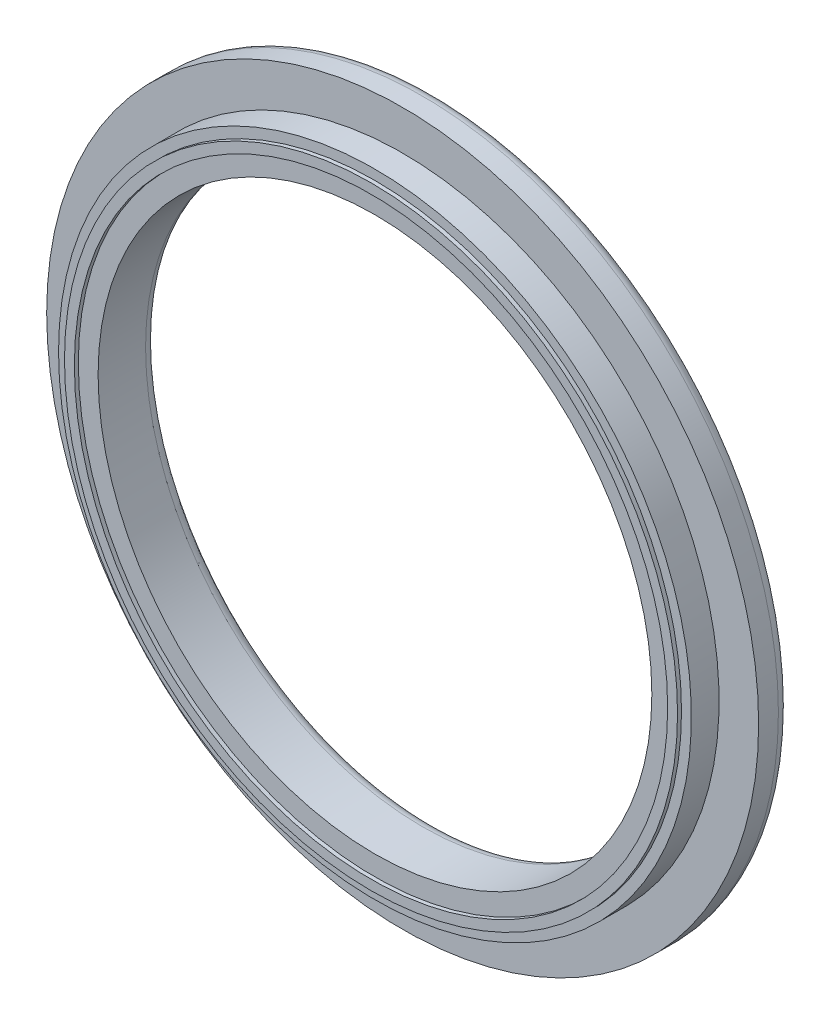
ISO-10303-21;
HEADER;
FILE_DESCRIPTION(('STEP AP214'),'2;1');
FILE_NAME('part.step','',(''),(''),'','','');
FILE_SCHEMA(('AUTOMOTIVE_DESIGN { 1 0 10303 214 1 1 1 1 }'));
ENDSEC;
DATA;
#1=APPLICATION_CONTEXT('core data for automotive mechanical design processes');
#2=APPLICATION_PROTOCOL_DEFINITION('international standard','automotive_design',2000,#1);
#3=PRODUCT_CONTEXT('',#1,'mechanical');
#4=PRODUCT('Part','Part','',(#3));
#5=PRODUCT_RELATED_PRODUCT_CATEGORY('part','',(#4));
#6=PRODUCT_DEFINITION_FORMATION('','',#4);
#7=PRODUCT_DEFINITION_CONTEXT('part definition',#1,'design');
#8=PRODUCT_DEFINITION('design','',#6,#7);
#9=PRODUCT_DEFINITION_SHAPE('','',#8);
#10=(LENGTH_UNIT() NAMED_UNIT(*) SI_UNIT(.MILLI.,.METRE.));
#11=(NAMED_UNIT(*) PLANE_ANGLE_UNIT() SI_UNIT($,.RADIAN.));
#12=(NAMED_UNIT(*) SI_UNIT($,.STERADIAN.) SOLID_ANGLE_UNIT());
#13=UNCERTAINTY_MEASURE_WITH_UNIT(LENGTH_MEASURE(1.E-05),#10,'distance_accuracy_value','');
#14=(GEOMETRIC_REPRESENTATION_CONTEXT(3) GLOBAL_UNCERTAINTY_ASSIGNED_CONTEXT((#13)) GLOBAL_UNIT_ASSIGNED_CONTEXT((#10,
#11,#12)) REPRESENTATION_CONTEXT('',''));
#15=CARTESIAN_POINT('',(0.,0.,0.));
#16=DIRECTION('',(0.,0.,1.));
#17=DIRECTION('',(1.,0.,0.));
#18=AXIS2_PLACEMENT_3D('',#15,#16,#17);
#19=CARTESIAN_POINT('',(0.,0.,1.6));
#20=DIRECTION('',(0.,0.,-1.));
#21=DIRECTION('',(-1.,0.,0.));
#22=AXIS2_PLACEMENT_3D('',#19,#20,#21);
#23=CYLINDRICAL_SURFACE('',#22,7.75);
#24=CARTESIAN_POINT('',(0.,0.,1.5));
#25=DIRECTION('',(0.,0.,-1.));
#26=DIRECTION('',(-1.,0.,0.));
#27=AXIS2_PLACEMENT_3D('',#24,#25,#26);
#28=CIRCLE('',#27,7.75);
#29=CARTESIAN_POINT('',(-7.75,0.,1.5));
#30=VERTEX_POINT('',#29);
#31=EDGE_CURVE('E123',#30,#30,#28,.T.);
#32=ORIENTED_EDGE('',*,*,#31,.F.);
#33=EDGE_LOOP('',(#32));
#34=FACE_BOUND('',#33,.T.);
#35=CARTESIAN_POINT('',(0.,0.,1.6));
#36=DIRECTION('',(0.,0.,-1.));
#37=DIRECTION('',(-1.,0.,0.));
#38=AXIS2_PLACEMENT_3D('',#35,#36,#37);
#39=CIRCLE('',#38,7.75);
#40=CARTESIAN_POINT('',(-7.75,0.,1.6));
#41=VERTEX_POINT('',#40);
#42=EDGE_CURVE('E125',#41,#41,#39,.F.);
#43=ORIENTED_EDGE('',*,*,#42,.F.);
#44=EDGE_LOOP('',(#43));
#45=FACE_BOUND('',#44,.T.);
#46=ADVANCED_FACE('F17',(#34,#45),#23,.T.);
#47=CARTESIAN_POINT('',(0.,0.,1.6));
#48=DIRECTION('',(0.,0.,1.));
#49=DIRECTION('',(1.,0.,0.));
#50=AXIS2_PLACEMENT_3D('',#47,#48,#49);
#51=PLANE('',#50);
#52=CARTESIAN_POINT('',(0.,0.,1.6));
#53=DIRECTION('',(0.,0.,-1.));
#54=DIRECTION('',(-1.,0.,0.));
#55=AXIS2_PLACEMENT_3D('',#52,#53,#54);
#56=CIRCLE('',#55,7.5);
#57=CARTESIAN_POINT('',(-7.5,0.,1.6));
#58=VERTEX_POINT('',#57);
#59=EDGE_CURVE('E120',#58,#58,#56,.T.);
#60=ORIENTED_EDGE('',*,*,#59,.T.);
#61=EDGE_LOOP('',(#60));
#62=FACE_BOUND('',#61,.T.);
#63=ORIENTED_EDGE('',*,*,#42,.T.);
#64=EDGE_LOOP('',(#63));
#65=FACE_BOUND('',#64,.T.);
#66=ADVANCED_FACE('F129',(#62,#65),#51,.T.);
#67=CARTESIAN_POINT('',(0.,0.,1.5));
#68=DIRECTION('',(0.,0.,1.));
#69=DIRECTION('',(1.,0.,0.));
#70=AXIS2_PLACEMENT_3D('',#67,#68,#69);
#71=PLANE('',#70);
#72=ORIENTED_EDGE('',*,*,#31,.T.);
#73=EDGE_LOOP('',(#72));
#74=FACE_BOUND('',#73,.T.);
#75=CARTESIAN_POINT('',(0.,0.,1.5));
#76=DIRECTION('',(0.,0.,-1.));
#77=DIRECTION('',(-1.,0.,0.));
#78=AXIS2_PLACEMENT_3D('',#75,#76,#77);
#79=CIRCLE('',#78,8.);
#80=CARTESIAN_POINT('',(-8.,0.,1.5));
#81=VERTEX_POINT('',#80);
#82=EDGE_CURVE('E117',#81,#81,#79,.T.);
#83=ORIENTED_EDGE('',*,*,#82,.F.);
#84=EDGE_LOOP('',(#83));
#85=FACE_BOUND('',#84,.T.);
#86=ADVANCED_FACE('F137',(#74,#85),#71,.T.);
#87=CARTESIAN_POINT('',(0.,0.,1.6));
#88=DIRECTION('',(0.,0.,-1.));
#89=DIRECTION('',(-1.,0.,0.));
#90=AXIS2_PLACEMENT_3D('',#87,#88,#89);
#91=CYLINDRICAL_SURFACE('',#90,7.5);
#92=CARTESIAN_POINT('',(0.,0.,1.5));
#93=DIRECTION('',(0.,0.,-1.));
#94=DIRECTION('',(-1.,0.,0.));
#95=AXIS2_PLACEMENT_3D('',#92,#93,#94);
#96=CIRCLE('',#95,7.5);
#97=CARTESIAN_POINT('',(-7.5,0.,1.5));
#98=VERTEX_POINT('',#97);
#99=EDGE_CURVE('E114',#98,#98,#96,.F.);
#100=ORIENTED_EDGE('',*,*,#99,.F.);
#101=EDGE_LOOP('',(#100));
#102=FACE_BOUND('',#101,.T.);
#103=ORIENTED_EDGE('',*,*,#59,.F.);
#104=EDGE_LOOP('',(#103));
#105=FACE_BOUND('',#104,.T.);
#106=ADVANCED_FACE('F184',(#102,#105),#91,.F.);
#107=CARTESIAN_POINT('',(0.,0.,1.5));
#108=DIRECTION('',(0.,0.,-1.));
#109=DIRECTION('',(-1.,0.,0.));
#110=AXIS2_PLACEMENT_3D('',#107,#108,#109);
#111=CYLINDRICAL_SURFACE('',#110,8.);
#112=CARTESIAN_POINT('',(0.,0.,0.8));
#113=DIRECTION('',(0.,0.,-1.));
#114=DIRECTION('',(-1.,0.,0.));
#115=AXIS2_PLACEMENT_3D('',#112,#113,#114);
#116=CIRCLE('',#115,8.);
#117=CARTESIAN_POINT('',(-8.,0.,0.8));
#118=VERTEX_POINT('',#117);
#119=EDGE_CURVE('E111',#118,#118,#116,.T.);
#120=ORIENTED_EDGE('',*,*,#119,.F.);
#121=EDGE_LOOP('',(#120));
#122=FACE_BOUND('',#121,.T.);
#123=ORIENTED_EDGE('',*,*,#82,.T.);
#124=EDGE_LOOP('',(#123));
#125=FACE_BOUND('',#124,.T.);
#126=ADVANCED_FACE('F180',(#122,#125),#111,.T.);
#127=CARTESIAN_POINT('',(0.,0.,1.5));
#128=DIRECTION('',(0.,0.,1.));
#129=DIRECTION('',(1.,0.,0.));
#130=AXIS2_PLACEMENT_3D('',#127,#128,#129);
#131=PLANE('',#130);
#132=CARTESIAN_POINT('',(0.,0.,1.5));
#133=DIRECTION('',(0.,0.,-1.));
#134=DIRECTION('',(-1.,0.,0.));
#135=AXIS2_PLACEMENT_3D('',#132,#133,#134);
#136=CIRCLE('',#135,7.);
#137=CARTESIAN_POINT('',(-7.,0.,1.5));
#138=VERTEX_POINT('',#137);
#139=EDGE_CURVE('E108',#138,#138,#136,.T.);
#140=ORIENTED_EDGE('',*,*,#139,.T.);
#141=EDGE_LOOP('',(#140));
#142=FACE_BOUND('',#141,.T.);
#143=ORIENTED_EDGE('',*,*,#99,.T.);
#144=EDGE_LOOP('',(#143));
#145=FACE_BOUND('',#144,.T.);
#146=ADVANCED_FACE('F176',(#142,#145),#131,.T.);
#147=CARTESIAN_POINT('',(0.,0.,0.8));
#148=DIRECTION('',(0.,0.,1.));
#149=DIRECTION('',(1.,0.,0.));
#150=AXIS2_PLACEMENT_3D('',#147,#148,#149);
#151=PLANE('',#150);
#152=ORIENTED_EDGE('',*,*,#119,.T.);
#153=EDGE_LOOP('',(#152));
#154=FACE_BOUND('',#153,.T.);
#155=CARTESIAN_POINT('',(0.,0.,0.8));
#156=DIRECTION('',(0.,0.,-1.));
#157=DIRECTION('',(-1.,0.,0.));
#158=AXIS2_PLACEMENT_3D('',#155,#156,#157);
#159=CIRCLE('',#158,9.);
#160=CARTESIAN_POINT('',(-9.,0.,0.8));
#161=VERTEX_POINT('',#160);
#162=EDGE_CURVE('E105',#161,#161,#159,.T.);
#163=ORIENTED_EDGE('',*,*,#162,.F.);
#164=EDGE_LOOP('',(#163));
#165=FACE_BOUND('',#164,.T.);
#166=ADVANCED_FACE('F170',(#154,#165),#151,.T.);
#167=CARTESIAN_POINT('',(0.,0.,0.8));
#168=DIRECTION('',(0.,0.,-1.));
#169=DIRECTION('',(-1.,0.,0.));
#170=AXIS2_PLACEMENT_3D('',#167,#168,#169);
#171=CYLINDRICAL_SURFACE('',#170,7.);
#172=ORIENTED_EDGE('',*,*,#139,.F.);
#173=EDGE_LOOP('',(#172));
#174=FACE_BOUND('',#173,.T.);
#175=CARTESIAN_POINT('',(0.,0.,0.3));
#176=DIRECTION('',(0.,0.,1.));
#177=DIRECTION('',(1.,0.,0.));
#178=AXIS2_PLACEMENT_3D('',#175,#176,#177);
#179=CIRCLE('',#178,7.);
#180=CARTESIAN_POINT('',(7.,0.,0.3));
#181=VERTEX_POINT('',#180);
#182=EDGE_CURVE('E102',#181,#181,#179,.T.);
#183=ORIENTED_EDGE('',*,*,#182,.F.);
#184=EDGE_LOOP('',(#183));
#185=FACE_BOUND('',#184,.T.);
#186=ADVANCED_FACE('F164',(#174,#185),#171,.F.);
#187=CARTESIAN_POINT('',(0.,0.,0.8));
#188=DIRECTION('',(0.,0.,-1.));
#189=DIRECTION('',(-1.,0.,0.));
#190=AXIS2_PLACEMENT_3D('',#187,#188,#189);
#191=CYLINDRICAL_SURFACE('',#190,9.);
#192=ORIENTED_EDGE('',*,*,#162,.T.);
#193=EDGE_LOOP('',(#192));
#194=FACE_BOUND('',#193,.T.);
#195=CARTESIAN_POINT('',(0.,0.,0.3));
#196=DIRECTION('',(0.,0.,1.));
#197=DIRECTION('',(1.,0.,0.));
#198=AXIS2_PLACEMENT_3D('',#195,#196,#197);
#199=CIRCLE('',#198,9.);
#200=CARTESIAN_POINT('',(9.,0.,0.3));
#201=VERTEX_POINT('',#200);
#202=EDGE_CURVE('E54',#201,#201,#199,.F.);
#203=ORIENTED_EDGE('',*,*,#202,.F.);
#204=EDGE_LOOP('',(#203));
#205=FACE_BOUND('',#204,.T.);
#206=ADVANCED_FACE('F162',(#194,#205),#191,.T.);
#207=CARTESIAN_POINT('',(0.,0.,0.3));
#208=DIRECTION('',(0.,0.,1.));
#209=DIRECTION('',(1.,0.,0.));
#210=AXIS2_PLACEMENT_3D('',#207,#208,#209);
#211=TOROIDAL_SURFACE('',#210,7.3,0.3);
#212=CARTESIAN_POINT('',(0.,0.,0.));
#213=DIRECTION('',(0.,0.,-1.));
#214=DIRECTION('',(1.,0.,0.));
#215=AXIS2_PLACEMENT_3D('',#212,#213,#214);
#216=CIRCLE('',#215,7.3);
#217=CARTESIAN_POINT('',(7.3,0.,0.));
#218=VERTEX_POINT('',#217);
#219=CARTESIAN_POINT('',(-7.3,0.,0.));
#220=VERTEX_POINT('',#219);
#221=EDGE_CURVE('E42',#218,#220,#216,.T.);
#222=ORIENTED_EDGE('',*,*,#221,.T.);
#223=CARTESIAN_POINT('',(0.,0.,0.));
#224=DIRECTION('',(0.,0.,-1.));
#225=DIRECTION('',(-1.,0.,0.));
#226=AXIS2_PLACEMENT_3D('',#223,#224,#225);
#227=CIRCLE('',#226,7.3);
#228=EDGE_CURVE('E45',#220,#218,#227,.T.);
#229=ORIENTED_EDGE('',*,*,#228,.T.);
#230=EDGE_LOOP('',(#222,#229));
#231=FACE_BOUND('',#230,.T.);
#232=ORIENTED_EDGE('',*,*,#182,.T.);
#233=EDGE_LOOP('',(#232));
#234=FACE_BOUND('',#233,.T.);
#235=ADVANCED_FACE('F52',(#231,#234),#211,.T.);
#236=CARTESIAN_POINT('',(0.,0.,0.3));
#237=DIRECTION('',(0.,0.,1.));
#238=DIRECTION('',(1.,0.,0.));
#239=AXIS2_PLACEMENT_3D('',#236,#237,#238);
#240=TOROIDAL_SURFACE('',#239,8.7,0.3);
#241=CARTESIAN_POINT('',(0.,0.,0.));
#242=DIRECTION('',(0.,0.,1.));
#243=DIRECTION('',(1.,0.,0.));
#244=AXIS2_PLACEMENT_3D('',#241,#242,#243);
#245=CIRCLE('',#244,8.7);
#246=CARTESIAN_POINT('',(8.7,0.,0.));
#247=VERTEX_POINT('',#246);
#248=CARTESIAN_POINT('',(-8.7,0.,0.));
#249=VERTEX_POINT('',#248);
#250=EDGE_CURVE('E28',#247,#249,#245,.T.);
#251=ORIENTED_EDGE('',*,*,#250,.T.);
#252=CARTESIAN_POINT('',(0.,0.,0.));
#253=DIRECTION('',(0.,0.,1.));
#254=DIRECTION('',(-1.,0.,0.));
#255=AXIS2_PLACEMENT_3D('',#252,#253,#254);
#256=CIRCLE('',#255,8.7);
#257=EDGE_CURVE('E11',#249,#247,#256,.T.);
#258=ORIENTED_EDGE('',*,*,#257,.T.);
#259=EDGE_LOOP('',(#251,#258));
#260=FACE_BOUND('',#259,.T.);
#261=ORIENTED_EDGE('',*,*,#202,.T.);
#262=EDGE_LOOP('',(#261));
#263=FACE_BOUND('',#262,.T.);
#264=ADVANCED_FACE('F61',(#260,#263),#240,.T.);
#265=CARTESIAN_POINT('',(0.,0.,0.));
#266=DIRECTION('',(0.,0.,1.));
#267=DIRECTION('',(1.,0.,0.));
#268=AXIS2_PLACEMENT_3D('',#265,#266,#267);
#269=PLANE('',#268);
#270=ORIENTED_EDGE('',*,*,#250,.F.);
#271=ORIENTED_EDGE('',*,*,#257,.F.);
#272=EDGE_LOOP('',(#270,#271));
#273=FACE_BOUND('',#272,.T.);
#274=ORIENTED_EDGE('',*,*,#221,.F.);
#275=ORIENTED_EDGE('',*,*,#228,.F.);
#276=EDGE_LOOP('',(#274,#275));
#277=FACE_BOUND('',#276,.T.);
#278=ADVANCED_FACE('F47',(#273,#277),#269,.F.);
#279=CLOSED_SHELL('',(#46,#66,#86,#106,#126,#146,#166,#186,#206,#235,#264,#278));
#280=MANIFOLD_SOLID_BREP('B1',#279);
#281=ADVANCED_BREP_SHAPE_REPRESENTATION('',(#18,#280),#14);
#282=SHAPE_DEFINITION_REPRESENTATION(#9,#281);
ENDSEC;
END-ISO-10303-21;
